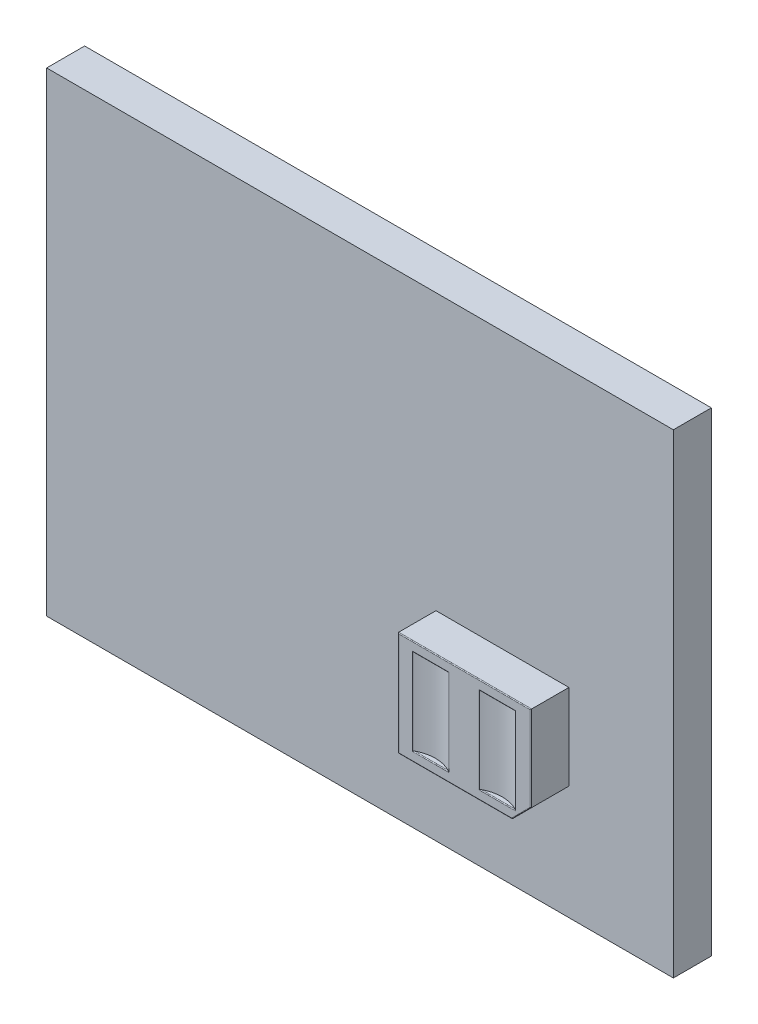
from build123d import *

# Parameters (mm, degrees)
ESQUISSE1_W             = 16.5
ESQUISSE1_H             = 12.5
EXTRUSION1_DEPTH        = 1
EXTRUSION2_DEPTH        = 2
ENL_V_MAT_EXTRU_1_DEPTH = 2.25
CONG_1_R                = 0.02


with BuildPart() as part:
    # Esquisse1 → Extrusion1 (new body)
    with BuildSketch(Plane.XY):
        Rectangle(ESQUISSE1_W, ESQUISSE1_H)
    extrude(amount=EXTRUSION1_DEPTH)

    # Esquisse3 → Extrusion2 (add)
    with BuildSketch(Plane.XY):
        Polygon((2, -1), (5.5, -1), (5.5, -3.25), (5, -3.75), (2, -3.75), align=None)
    extrude(amount=EXTRUSION2_DEPTH)

    # Esquisse4 → Enl_v. mat.-Extru.1 (cut)
    with BuildSketch(Plane.XZ.offset(3.5)):
        with BuildLine():
            Line((2.384572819, 2), (3.334776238, 2))
            ThreePointArc((3.334776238, 2), (2.859674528, 1.872882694), (2.384572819, 2))
        make_face()
        with BuildLine():
            Line((5.09220572, 2), (4.142002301, 2))
            ThreePointArc((4.142002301, 2), (4.61710401, 1.872882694), (5.09220572, 2))
        make_face()
    extrude(amount=-ENL_V_MAT_EXTRU_1_DEPTH, mode=Mode.SUBTRACT)

    # Cong_1
    cong_1_edges = [part.edges().sort_by_distance(p)[0] for p in [
        (3.75, -1, 2),
        (5.5, -2.125, 2),
        (5.25, -3.5, 2),
        (3.5, -3.75, 2),
        (2, -2.375, 2),
        (4.61710401, -3.5, 2),
        (4.142002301, -2.375, 2),
        (4.61710401, -1.25, 2),
        (5.09220572, -2.375, 2),
        (2.384572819, -2.375, 2),
        (2.859674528, -1.25, 2),
        (3.334776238, -2.375, 2),
        (2.859674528, -3.5, 2),
    ]]
    fillet(cong_1_edges, radius=CONG_1_R)


solid = part.part
